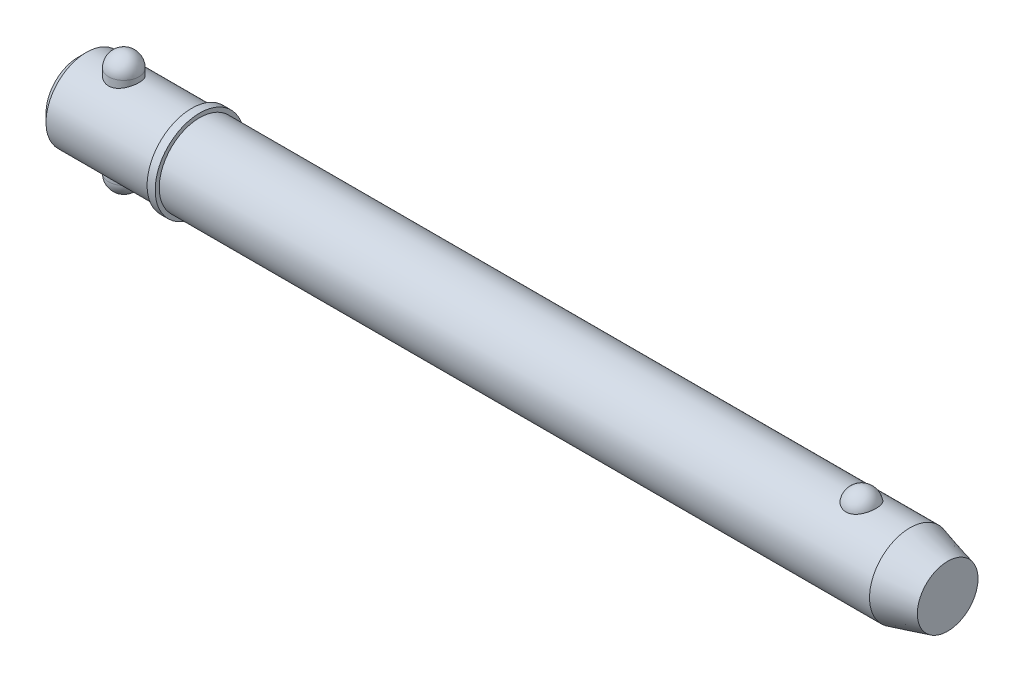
ISO-10303-21;
HEADER;
FILE_DESCRIPTION(('STEP AP214'),'2;1');
FILE_NAME('part.step','',(''),(''),'','','');
FILE_SCHEMA(('AUTOMOTIVE_DESIGN { 1 0 10303 214 1 1 1 1 }'));
ENDSEC;
DATA;
#1=APPLICATION_CONTEXT('core data for automotive mechanical design processes');
#2=APPLICATION_PROTOCOL_DEFINITION('international standard','automotive_design',2000,#1);
#3=PRODUCT_CONTEXT('',#1,'mechanical');
#4=PRODUCT('Part','Part','',(#3));
#5=PRODUCT_RELATED_PRODUCT_CATEGORY('part','',(#4));
#6=PRODUCT_DEFINITION_FORMATION('','',#4);
#7=PRODUCT_DEFINITION_CONTEXT('part definition',#1,'design');
#8=PRODUCT_DEFINITION('design','',#6,#7);
#9=PRODUCT_DEFINITION_SHAPE('','',#8);
#10=(LENGTH_UNIT() NAMED_UNIT(*) SI_UNIT(.MILLI.,.METRE.));
#11=(NAMED_UNIT(*) PLANE_ANGLE_UNIT() SI_UNIT($,.RADIAN.));
#12=(NAMED_UNIT(*) SI_UNIT($,.STERADIAN.) SOLID_ANGLE_UNIT());
#13=UNCERTAINTY_MEASURE_WITH_UNIT(LENGTH_MEASURE(1.E-05),#10,'distance_accuracy_value','');
#14=(GEOMETRIC_REPRESENTATION_CONTEXT(3) GLOBAL_UNCERTAINTY_ASSIGNED_CONTEXT((#13)) GLOBAL_UNIT_ASSIGNED_CONTEXT((#10,
#11,#12)) REPRESENTATION_CONTEXT('',''));
#15=CARTESIAN_POINT('',(0.,0.,0.));
#16=DIRECTION('',(0.,0.,1.));
#17=DIRECTION('',(1.,0.,0.));
#18=AXIS2_PLACEMENT_3D('',#15,#16,#17);
#19=CARTESIAN_POINT('',(14.28,19.05,0.));
#20=DIRECTION('',(0.,-1.,0.));
#21=DIRECTION('',(0.,0.,-1.));
#22=AXIS2_PLACEMENT_3D('',#19,#20,#21);
#23=CYLINDRICAL_SURFACE('',#22,4.76);
#24=CARTESIAN_POINT('',(14.28,-14.29,0.));
#25=DIRECTION('',(0.,-1.,0.));
#26=DIRECTION('',(0.,0.,-1.));
#27=AXIS2_PLACEMENT_3D('',#24,#25,#26);
#28=CIRCLE('',#27,4.76);
#29=CARTESIAN_POINT('',(14.28,-14.29,-4.76));
#30=VERTEX_POINT('',#29);
#31=EDGE_CURVE('P0_E10',#30,#30,#28,.F.);
#32=CARTESIAN_POINT('',(14.28,14.29,0.));
#33=DIRECTION('',(0.,-1.,0.));
#34=DIRECTION('',(0.,0.,-1.));
#35=AXIS2_PLACEMENT_3D('',#32,#33,#34);
#36=CIRCLE('',#35,4.76);
#37=CARTESIAN_POINT('',(14.28,14.29,-4.76));
#38=VERTEX_POINT('',#37);
#39=EDGE_CURVE('P0_E21',#38,#38,#36,.T.);
#40=CARTESIAN_POINT('',(14.28,-14.29,-4.76));
#41=CARTESIAN_POINT('',(14.28,-13.9922916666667,-4.76));
#42=CARTESIAN_POINT('',(14.28,-13.6945833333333,-4.76));
#43=CARTESIAN_POINT('',(14.28,-13.0991666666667,-4.76));
#44=CARTESIAN_POINT('',(14.28,-12.8014583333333,-4.76));
#45=CARTESIAN_POINT('',(14.28,-12.2060416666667,-4.76));
#46=CARTESIAN_POINT('',(14.28,-11.9083333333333,-4.76));
#47=CARTESIAN_POINT('',(14.28,-11.3129166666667,-4.76));
#48=CARTESIAN_POINT('',(14.28,-11.0152083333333,-4.76));
#49=CARTESIAN_POINT('',(14.28,-10.4197916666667,-4.76));
#50=CARTESIAN_POINT('',(14.28,-10.1220833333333,-4.76));
#51=CARTESIAN_POINT('',(14.28,-9.52666666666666,-4.76));
#52=CARTESIAN_POINT('',(14.28,-9.22895833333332,-4.76));
#53=CARTESIAN_POINT('',(14.28,-8.63354166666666,-4.76));
#54=CARTESIAN_POINT('',(14.28,-8.33583333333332,-4.76));
#55=CARTESIAN_POINT('',(14.28,-7.74041666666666,-4.76));
#56=CARTESIAN_POINT('',(14.28,-7.44270833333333,-4.76));
#57=CARTESIAN_POINT('',(14.28,-6.84729166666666,-4.76));
#58=CARTESIAN_POINT('',(14.28,-6.54958333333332,-4.76));
#59=CARTESIAN_POINT('',(14.28,-5.95416666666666,-4.76));
#60=CARTESIAN_POINT('',(14.28,-5.65645833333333,-4.76));
#61=CARTESIAN_POINT('',(14.28,-5.06104166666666,-4.76));
#62=CARTESIAN_POINT('',(14.28,-4.76333333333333,-4.76));
#63=CARTESIAN_POINT('',(14.28,-4.16791666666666,-4.76));
#64=CARTESIAN_POINT('',(14.28,-3.87020833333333,-4.76));
#65=CARTESIAN_POINT('',(14.28,-3.27479166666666,-4.76));
#66=CARTESIAN_POINT('',(14.28,-2.97708333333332,-4.76));
#67=CARTESIAN_POINT('',(14.28,-2.38166666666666,-4.76));
#68=CARTESIAN_POINT('',(14.28,-2.08395833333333,-4.76));
#69=CARTESIAN_POINT('',(14.28,-1.48854166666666,-4.76));
#70=CARTESIAN_POINT('',(14.28,-1.19083333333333,-4.76));
#71=CARTESIAN_POINT('',(14.28,-0.595416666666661,-4.76));
#72=CARTESIAN_POINT('',(14.28,-0.297708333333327,-4.76));
#73=CARTESIAN_POINT('',(14.28,0.297708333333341,-4.76));
#74=CARTESIAN_POINT('',(14.28,0.595416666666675,-4.76));
#75=CARTESIAN_POINT('',(14.28,1.19083333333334,-4.76));
#76=CARTESIAN_POINT('',(14.28,1.48854166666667,-4.76));
#77=CARTESIAN_POINT('',(14.28,2.08395833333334,-4.76));
#78=CARTESIAN_POINT('',(14.28,2.38166666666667,-4.76));
#79=CARTESIAN_POINT('',(14.28,2.97708333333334,-4.76));
#80=CARTESIAN_POINT('',(14.28,3.27479166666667,-4.76));
#81=CARTESIAN_POINT('',(14.28,3.87020833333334,-4.76));
#82=CARTESIAN_POINT('',(14.28,4.16791666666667,-4.76));
#83=CARTESIAN_POINT('',(14.28,4.76333333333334,-4.76));
#84=CARTESIAN_POINT('',(14.28,5.06104166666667,-4.76));
#85=CARTESIAN_POINT('',(14.28,5.65645833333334,-4.76));
#86=CARTESIAN_POINT('',(14.28,5.95416666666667,-4.76));
#87=CARTESIAN_POINT('',(14.28,6.54958333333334,-4.76));
#88=CARTESIAN_POINT('',(14.28,6.84729166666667,-4.76));
#89=CARTESIAN_POINT('',(14.28,7.44270833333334,-4.76));
#90=CARTESIAN_POINT('',(14.28,7.74041666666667,-4.76));
#91=CARTESIAN_POINT('',(14.28,8.33583333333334,-4.76));
#92=CARTESIAN_POINT('',(14.28,8.63354166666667,-4.76));
#93=CARTESIAN_POINT('',(14.28,9.22895833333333,-4.76));
#94=CARTESIAN_POINT('',(14.28,9.52666666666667,-4.76));
#95=CARTESIAN_POINT('',(14.28,10.1220833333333,-4.76));
#96=CARTESIAN_POINT('',(14.28,10.4197916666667,-4.76));
#97=CARTESIAN_POINT('',(14.28,11.0152083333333,-4.76));
#98=CARTESIAN_POINT('',(14.28,11.3129166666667,-4.76));
#99=CARTESIAN_POINT('',(14.28,11.9083333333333,-4.76));
#100=CARTESIAN_POINT('',(14.28,12.2060416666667,-4.76));
#101=CARTESIAN_POINT('',(14.28,12.8014583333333,-4.76));
#102=CARTESIAN_POINT('',(14.28,13.0991666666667,-4.76));
#103=CARTESIAN_POINT('',(14.28,13.6945833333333,-4.76));
#104=CARTESIAN_POINT('',(14.28,13.9922916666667,-4.76));
#105=CARTESIAN_POINT('',(14.28,14.29,-4.76));
#106=B_SPLINE_CURVE_WITH_KNOTS('',3,(#40,#41,#42,#43,#44,#45,#46,#47,#48,#49,#50,#51,#52,#53,
#54,#55,#56,#57,#58,#59,#60,#61,#62,#63,#64,#65,#66,#67,#68,#69,#70,#71,#72,#73,#74,#75,#76,#77,
#78,#79,#80,#81,#82,#83,#84,#85,#86,#87,#88,#89,#90,#91,#92,#93,#94,#95,#96,#97,#98,#99,#100,
#101,#102,#103,#104,#105),.UNSPECIFIED.,.F.,.F.,(4,2,2,2,2,2,2,2,2,2,2,2,2,2,2,2,2,2,2,2,2,2,2,
2,2,2,2,2,2,2,2,2,4),(0.,0.893125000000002,1.78625,2.67937499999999,3.5725,4.465625,5.35875,
6.25187499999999,7.145,8.038125,8.93125,9.82437499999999,10.7175,11.610625,12.50375,13.396875,
14.29,15.183125,16.07625,16.969375,17.8625,18.755625,19.64875,20.541875,21.435,22.328125,
23.22125,24.114375,25.0075,25.900625,26.79375,27.686875,28.58),.UNSPECIFIED.);
#107=EDGE_CURVE('P0_BSEAM14',#30,#38,#106,.T.);
#108=ORIENTED_EDGE('',*,*,#31,.T.);
#109=ORIENTED_EDGE('',*,*,#39,.T.);
#110=ORIENTED_EDGE('',*,*,#107,.T.);
#111=ORIENTED_EDGE('',*,*,#107,.F.);
#112=EDGE_LOOP('',(#108,#110,#109,#111));
#113=FACE_BOUND('',#112,.T.);
#114=ADVANCED_FACE('P0_F14',(#113),#23,.T.);
#115=CARTESIAN_POINT('',(14.28,-14.29,0.));
#116=DIRECTION('',(0.,0.,1.));
#117=DIRECTION('',(1.,0.,0.));
#118=AXIS2_PLACEMENT_3D('',#115,#116,#117);
#119=SPHERICAL_SURFACE('',#118,4.76);
#120=CARTESIAN_POINT('',(14.28,-14.29,0.));
#121=DIRECTION('',(0.,-1.,0.));
#122=DIRECTION('',(0.,0.,-1.));
#123=AXIS2_PLACEMENT_3D('',#120,#121,#122);
#124=SPHERICAL_SURFACE('',#123,4.76);
#125=ORIENTED_EDGE('',*,*,#31,.F.);
#126=EDGE_LOOP('',(#125));
#127=FACE_BOUND('',#126,.T.);
#128=ADVANCED_FACE('P0_F29',(#127),#124,.T.);
#129=CARTESIAN_POINT('',(14.28,14.29,0.));
#130=DIRECTION('',(0.,0.,1.));
#131=DIRECTION('',(1.,0.,0.));
#132=AXIS2_PLACEMENT_3D('',#129,#130,#131);
#133=SPHERICAL_SURFACE('',#132,4.76);
#134=CARTESIAN_POINT('',(14.28,14.29,0.));
#135=DIRECTION('',(0.,-1.,0.));
#136=DIRECTION('',(0.,0.,-1.));
#137=AXIS2_PLACEMENT_3D('',#134,#135,#136);
#138=SPHERICAL_SURFACE('',#137,4.76);
#139=ORIENTED_EDGE('',*,*,#39,.F.);
#140=EDGE_LOOP('',(#139));
#141=FACE_BOUND('',#140,.T.);
#142=ADVANCED_FACE('P0_F16',(#141),#138,.T.);
#143=CLOSED_SHELL('',(#114,#128,#142));
#144=MANIFOLD_SOLID_BREP('P0_B1',#143);
#145=CARTESIAN_POINT('',(0.,0.,0.));
#146=DIRECTION('',(1.,0.,0.));
#147=DIRECTION('',(0.,0.,-1.));
#148=AXIS2_PLACEMENT_3D('',#145,#146,#147);
#149=CYLINDRICAL_SURFACE('',#148,12.7);
#150=CARTESIAN_POINT('',(261.200738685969,0.,0.));
#151=DIRECTION('',(1.,0.,0.));
#152=DIRECTION('',(0.,0.,-1.));
#153=AXIS2_PLACEMENT_3D('',#150,#151,#152);
#154=CIRCLE('',#153,12.7);
#155=CARTESIAN_POINT('',(261.200738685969,0.,-12.7));
#156=VERTEX_POINT('',#155);
#157=EDGE_CURVE('P1_E81',#156,#156,#154,.T.);
#158=ORIENTED_EDGE('',*,*,#157,.F.);
#159=EDGE_LOOP('',(#158));
#160=FACE_BOUND('',#159,.T.);
#161=CARTESIAN_POINT('',(38.1,0.,0.));
#162=DIRECTION('',(1.,0.,0.));
#163=DIRECTION('',(0.,0.,-1.));
#164=AXIS2_PLACEMENT_3D('',#161,#162,#163);
#165=CIRCLE('',#164,12.7);
#166=CARTESIAN_POINT('',(38.1,0.,-12.7));
#167=VERTEX_POINT('',#166);
#168=EDGE_CURVE('P1_E85',#167,#167,#165,.T.);
#169=ORIENTED_EDGE('',*,*,#168,.T.);
#170=EDGE_LOOP('',(#169));
#171=FACE_BOUND('',#170,.T.);
#172=CARTESIAN_POINT('',(245.960042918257,11.7500437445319,4.81938502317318));
#173=CARTESIAN_POINT('',(245.835088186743,11.7500430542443,4.81938571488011));
#174=CARTESIAN_POINT('',(245.710144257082,11.7520975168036,4.81438658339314));
#175=CARTESIAN_POINT('',(245.461142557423,11.760253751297,4.79442904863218));
#176=CARTESIAN_POINT('',(245.337085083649,11.7663568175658,4.77946746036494));
#177=CARTESIAN_POINT('',(245.090901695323,11.7824262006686,4.7397141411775));
#178=CARTESIAN_POINT('',(244.968774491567,11.7923898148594,4.71492928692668));
#179=CARTESIAN_POINT('',(244.727187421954,11.8158938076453,4.65571340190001));
#180=CARTESIAN_POINT('',(244.60772859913,11.8294355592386,4.6212786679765));
#181=CARTESIAN_POINT('',(244.372557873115,11.8596812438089,4.54309502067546));
#182=CARTESIAN_POINT('',(244.256839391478,11.8763792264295,4.49936361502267));
#183=CARTESIAN_POINT('',(244.029653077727,11.9124878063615,4.40287235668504));
#184=CARTESIAN_POINT('',(243.918186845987,11.9318994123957,4.35010914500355));
#185=CARTESIAN_POINT('',(243.591278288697,11.9934256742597,4.17881316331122));
#186=CARTESIAN_POINT('',(243.383127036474,12.038858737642,4.04720756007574));
#187=CARTESIAN_POINT('',(242.985850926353,12.1352173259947,3.748564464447));
#188=CARTESIAN_POINT('',(242.797443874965,12.1862630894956,3.58061821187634));
#189=CARTESIAN_POINT('',(242.450521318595,12.2875163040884,3.21600758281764));
#190=CARTESIAN_POINT('',(242.292011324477,12.3377235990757,3.0193379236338));
#191=CARTESIAN_POINT('',(242.00168878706,12.4344923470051,2.592916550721));
#192=CARTESIAN_POINT('',(241.871376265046,12.4807925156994,2.36208286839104));
#193=CARTESIAN_POINT('',(241.649407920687,12.5623454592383,1.88070399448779));
#194=CARTESIAN_POINT('',(241.557755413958,12.5975972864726,1.63015711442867));
#195=CARTESIAN_POINT('',(241.414046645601,12.6538414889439,1.1129886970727));
#196=CARTESIAN_POINT('',(241.362499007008,12.6746503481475,0.846205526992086));
#197=CARTESIAN_POINT('',(241.301977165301,12.699153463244,0.307085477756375));
#198=CARTESIAN_POINT('',(241.293001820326,12.7028481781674,0.034748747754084));
#199=CARTESIAN_POINT('',(241.317731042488,12.6927785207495,-0.506073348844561));
#200=CARTESIAN_POINT('',(241.351189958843,12.6791146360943,-0.774571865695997));
#201=CARTESIAN_POINT('',(241.459687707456,12.635882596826,-1.30170246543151));
#202=CARTESIAN_POINT('',(241.53472729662,12.606314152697,-1.56033436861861));
#203=CARTESIAN_POINT('',(241.72500006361,12.5342328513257,-2.0608389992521));
#204=CARTESIAN_POINT('',(241.840287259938,12.4917026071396,-2.30268867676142));
#205=CARTESIAN_POINT('',(242.108704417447,12.3981123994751,-2.76259600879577));
#206=CARTESIAN_POINT('',(242.261837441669,12.3470517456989,-2.98065173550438));
#207=CARTESIAN_POINT('',(242.603507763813,12.2416045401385,-3.38786328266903));
#208=CARTESIAN_POINT('',(242.792201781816,12.1872040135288,-3.57688418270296));
#209=CARTESIAN_POINT('',(243.200239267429,12.0814086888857,-3.91941073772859));
#210=CARTESIAN_POINT('',(243.419580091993,12.0300136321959,-4.07291945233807));
#211=CARTESIAN_POINT('',(243.878375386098,11.9373542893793,-4.33691289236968));
#212=CARTESIAN_POINT('',(244.117304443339,11.8958982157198,-4.44824125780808));
#213=CARTESIAN_POINT('',(244.61243761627,11.8268116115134,-4.62881985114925));
#214=CARTESIAN_POINT('',(244.868635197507,11.7991758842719,-4.69808589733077));
#215=CARTESIAN_POINT('',(245.377164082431,11.7622209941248,-4.78983181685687));
#216=CARTESIAN_POINT('',(245.629041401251,11.7520502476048,-4.81449025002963));
#217=CARTESIAN_POINT('',(246.133573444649,11.7485796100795,-4.82295735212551));
#218=CARTESIAN_POINT('',(246.386228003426,11.7552763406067,-4.80677420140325));
#219=CARTESIAN_POINT('',(246.876834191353,11.7842584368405,-4.73525430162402));
#220=CARTESIAN_POINT('',(247.114998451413,11.8060486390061,-4.68116061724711));
#221=CARTESIAN_POINT('',(247.578489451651,11.8622750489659,-4.53678133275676));
#222=CARTESIAN_POINT('',(247.803815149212,11.8967122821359,-4.44649279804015));
#223=CARTESIAN_POINT('',(248.240801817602,11.9754603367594,-4.2298761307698));
#224=CARTESIAN_POINT('',(248.452057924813,12.0199699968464,-4.10280539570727));
#225=CARTESIAN_POINT('',(248.850601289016,12.1138028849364,-3.81685409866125));
#226=CARTESIAN_POINT('',(249.037883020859,12.163127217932,-3.65796622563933));
#227=CARTESIAN_POINT('',(249.393350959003,12.2642343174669,-3.30364864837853));
#228=CARTESIAN_POINT('',(249.560111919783,12.3160165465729,-3.10678783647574));
#229=CARTESIAN_POINT('',(249.859579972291,12.4142566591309,-2.68748409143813));
#230=CARTESIAN_POINT('',(249.992280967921,12.4607135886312,-2.46503658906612));
#231=CARTESIAN_POINT('',(250.224691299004,12.5450236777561,-1.99289519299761));
#232=CARTESIAN_POINT('',(250.323215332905,12.5825557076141,-1.74255918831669));
#233=CARTESIAN_POINT('',(250.479227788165,12.6431720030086,-1.22773734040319));
#234=CARTESIAN_POINT('',(250.536715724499,12.6662560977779,-0.963251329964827));
#235=CARTESIAN_POINT('',(250.609544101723,12.6956486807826,-0.427355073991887));
#236=CARTESIAN_POINT('',(250.624837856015,12.7019385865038,-0.155937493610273));
#237=CARTESIAN_POINT('',(250.612779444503,12.6970201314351,0.385928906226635));
#238=CARTESIAN_POINT('',(250.58542805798,12.6858120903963,0.65637774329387));
#239=CARTESIAN_POINT('',(250.513060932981,12.6568455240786,1.05454017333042));
#240=CARTESIAN_POINT('',(250.483796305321,12.6451962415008,1.185778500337));
#241=CARTESIAN_POINT('',(250.415022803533,12.6181819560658,1.44513808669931));
#242=CARTESIAN_POINT('',(250.375517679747,12.6028183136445,1.57326046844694));
#243=CARTESIAN_POINT('',(250.286439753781,12.5687547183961,1.82554978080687));
#244=CARTESIAN_POINT('',(250.236862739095,12.5500533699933,1.9497150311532));
#245=CARTESIAN_POINT('',(250.12792115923,12.5098093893,2.1931437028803));
#246=CARTESIAN_POINT('',(250.068560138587,12.4882677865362,2.31240887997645));
#247=CARTESIAN_POINT('',(249.93997128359,12.4427679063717,2.54593031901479));
#248=CARTESIAN_POINT('',(249.870688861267,12.4187964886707,2.66015396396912));
#249=CARTESIAN_POINT('',(249.722903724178,12.3691892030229,2.88202659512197));
#250=CARTESIAN_POINT('',(249.644404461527,12.3435539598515,2.98967802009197));
#251=CARTESIAN_POINT('',(249.478550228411,12.2912955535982,3.19774385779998));
#252=CARTESIAN_POINT('',(249.391191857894,12.2646720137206,3.29815546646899));
#253=CARTESIAN_POINT('',(249.208161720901,12.2111945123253,3.49095035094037));
#254=CARTESIAN_POINT('',(249.112493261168,12.1843406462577,3.58333679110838));
#255=CARTESIAN_POINT('',(248.913627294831,12.1312249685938,3.75922876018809));
#256=CARTESIAN_POINT('',(248.810450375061,12.104961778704,3.84275713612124));
#257=CARTESIAN_POINT('',(248.597013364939,12.0537284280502,4.00056406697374));
#258=CARTESIAN_POINT('',(248.486756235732,12.028757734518,4.07484645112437));
#259=CARTESIAN_POINT('',(248.259755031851,11.9808306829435,4.21367959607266));
#260=CARTESIAN_POINT('',(248.143006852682,11.9578756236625,4.27822410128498));
#261=CARTESIAN_POINT('',(247.90394258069,11.9147184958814,4.39698483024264));
#262=CARTESIAN_POINT('',(247.781628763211,11.894515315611,4.45120522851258));
#263=CARTESIAN_POINT('',(247.522952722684,11.8561129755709,4.55255353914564));
#264=CARTESIAN_POINT('',(247.386223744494,11.8381764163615,4.59884858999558));
#265=CARTESIAN_POINT('',(247.108608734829,11.8069093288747,4.67853897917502));
#266=CARTESIAN_POINT('',(246.967724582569,11.7935767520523,4.71194005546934));
#267=CARTESIAN_POINT('',(246.68309446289,11.7720277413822,4.76552188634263));
#268=CARTESIAN_POINT('',(246.539348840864,11.7638106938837,4.78570422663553));
#269=CARTESIAN_POINT('',(246.250411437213,11.7528195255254,4.81263433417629));
#270=CARTESIAN_POINT('',(246.105219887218,11.7500445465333,4.81938421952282));
#271=CARTESIAN_POINT('',(245.960042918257,11.7500437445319,4.81938502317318));
#272=B_SPLINE_CURVE_WITH_KNOTS('',3,(#172,#173,#174,#175,#176,#177,#178,#179,#180,#181,#182,
#183,#184,#185,#186,#187,#188,#189,#190,#191,#192,#193,#194,#195,#196,#197,#198,#199,#200,#201,
#202,#203,#204,#205,#206,#207,#208,#209,#210,#211,#212,#213,#214,#215,#216,#217,#218,#219,#220,
#221,#222,#223,#224,#225,#226,#227,#228,#229,#230,#231,#232,#233,#234,#235,#236,#237,#238,#239,
#240,#241,#242,#243,#244,#245,#246,#247,#248,#249,#250,#251,#252,#253,#254,#255,#256,#257,#258,
#259,#260,#261,#262,#263,#264,#265,#266,#267,#268,#269,#270,#271),.UNSPECIFIED.,.T.,.F.,(4,2,2,
2,2,2,2,2,2,2,2,2,2,2,2,2,2,2,2,2,2,2,2,2,2,2,2,2,2,2,2,2,2,2,2,2,2,2,2,2,2,2,2,2,2,2,2,2,2,4),
(0.,0.374729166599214,0.749578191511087,1.12416526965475,1.49889629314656,1.87292776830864,
2.24709865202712,2.99481328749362,3.76399449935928,4.53331735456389,5.3368391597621,
6.14042986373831,6.95405296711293,7.76765424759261,8.57656703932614,9.38549455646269,
10.1955119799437,11.0055949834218,11.8193353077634,12.6330054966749,13.4294141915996,
14.2255231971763,14.9815786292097,15.7374826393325,16.4696948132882,17.2019663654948,
17.9501979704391,18.6986017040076,19.484470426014,20.2704797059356,21.0815215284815,
21.8925729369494,22.7045213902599,23.5164550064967,23.9209608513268,24.3253187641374,
24.7298461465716,25.1342272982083,25.54092555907,25.9474719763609,26.3541750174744,
26.7607169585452,27.1661834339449,27.5714814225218,27.9770386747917,28.3824315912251,
28.8181206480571,29.2536155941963,29.6890582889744,30.1244323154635),.UNSPECIFIED.);
#273=CARTESIAN_POINT('',(245.960042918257,11.7500437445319,4.81938502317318));
#274=VERTEX_POINT('',#273);
#275=EDGE_CURVE('P1_E35',#274,#274,#272,.T.);
#276=ORIENTED_EDGE('',*,*,#275,.T.);
#277=EDGE_LOOP('',(#276));
#278=FACE_BOUND('',#277,.T.);
#279=ADVANCED_FACE('P1_F13',(#160,#171,#278),#149,.T.);
#280=CARTESIAN_POINT('',(0.,0.,0.));
#281=DIRECTION('',(-1.,0.,0.));
#282=DIRECTION('',(0.,0.,1.));
#283=AXIS2_PLACEMENT_3D('',#280,#281,#282);
#284=PLANE('',#283);
#285=CARTESIAN_POINT('',(0.,0.,0.));
#286=DIRECTION('',(1.,0.,0.));
#287=DIRECTION('',(0.,0.,-1.));
#288=AXIS2_PLACEMENT_3D('',#285,#286,#287);
#289=CIRCLE('',#288,10.16);
#290=CARTESIAN_POINT('',(0.,0.,-10.16));
#291=VERTEX_POINT('',#290);
#292=EDGE_CURVE('P1_E9',#291,#291,#289,.T.);
#293=ORIENTED_EDGE('',*,*,#292,.F.);
#294=EDGE_LOOP('',(#293));
#295=FACE_BOUND('',#294,.T.);
#296=ADVANCED_FACE('P1_F15',(#295),#284,.T.);
#297=CARTESIAN_POINT('',(2.53999999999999,0.,0.));
#298=DIRECTION('',(1.,0.,0.));
#299=DIRECTION('',(0.,0.,-1.));
#300=AXIS2_PLACEMENT_3D('',#297,#298,#299);
#301=CONICAL_SURFACE('',#300,12.7,0.78539816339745);
#302=ORIENTED_EDGE('',*,*,#292,.T.);
#303=EDGE_LOOP('',(#302));
#304=FACE_BOUND('',#303,.T.);
#305=CARTESIAN_POINT('',(2.53999999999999,0.,0.));
#306=DIRECTION('',(1.,0.,0.));
#307=DIRECTION('',(0.,0.,-1.));
#308=AXIS2_PLACEMENT_3D('',#305,#306,#307);
#309=CIRCLE('',#308,12.7);
#310=CARTESIAN_POINT('',(2.53999999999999,0.,-12.7));
#311=VERTEX_POINT('',#310);
#312=EDGE_CURVE('P1_E26',#311,#311,#309,.T.);
#313=ORIENTED_EDGE('',*,*,#312,.F.);
#314=EDGE_LOOP('',(#313));
#315=FACE_BOUND('',#314,.T.);
#316=ADVANCED_FACE('P1_F77',(#304,#315),#301,.T.);
#317=CARTESIAN_POINT('',(0.,0.,0.));
#318=DIRECTION('',(1.,0.,0.));
#319=DIRECTION('',(0.,0.,-1.));
#320=AXIS2_PLACEMENT_3D('',#317,#318,#319);
#321=CYLINDRICAL_SURFACE('',#320,12.7);
#322=CARTESIAN_POINT('',(14.28,-11.7742260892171,4.76));
#323=CARTESIAN_POINT('',(14.1514948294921,-11.7742255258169,4.76000061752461));
#324=CARTESIAN_POINT('',(14.0229980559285,-11.7763355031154,4.75479194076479));
#325=CARTESIAN_POINT('',(13.7669369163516,-11.7847043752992,4.73401198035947));
#326=CARTESIAN_POINT('',(13.6393728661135,-11.7909646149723,4.71843733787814));
#327=CARTESIAN_POINT('',(13.386226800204,-11.8074248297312,4.67709434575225));
#328=CARTESIAN_POINT('',(13.2606439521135,-11.8176231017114,4.65133040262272));
#329=CARTESIAN_POINT('',(13.0122434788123,-11.8416347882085,4.58985545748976));
#330=CARTESIAN_POINT('',(12.8894269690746,-11.8554496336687,4.55414051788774));
#331=CARTESIAN_POINT('',(12.6477622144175,-11.8862222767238,4.47320764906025));
#332=CARTESIAN_POINT('',(12.5289037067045,-11.9031710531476,4.4280169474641));
#333=CARTESIAN_POINT('',(12.2955059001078,-11.939736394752,4.32845291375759));
#334=CARTESIAN_POINT('',(12.1809682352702,-11.9593539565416,4.2740761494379));
#335=CARTESIAN_POINT('',(11.8448901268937,-12.0213893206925,4.09777237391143));
#336=CARTESIAN_POINT('',(11.6307077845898,-12.0670135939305,3.9626122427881));
#337=CARTESIAN_POINT('',(11.2179129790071,-12.1641514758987,3.65386230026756));
#338=CARTESIAN_POINT('',(11.0204399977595,-12.2158379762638,3.47881300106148));
#339=CARTESIAN_POINT('',(10.6568212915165,-12.3178468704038,3.09829182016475));
#340=CARTESIAN_POINT('',(10.4906822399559,-12.3681689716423,2.89281347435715));
#341=CARTESIAN_POINT('',(10.1890299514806,-12.4638367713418,2.44867909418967));
#342=CARTESIAN_POINT('',(10.054749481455,-12.5089552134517,2.20913281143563));
#343=CARTESIAN_POINT('',(9.82886079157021,-12.5870472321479,1.70885919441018));
#344=CARTESIAN_POINT('',(9.73723778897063,-12.620025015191,1.44813923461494));
#345=CARTESIAN_POINT('',(9.60324488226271,-12.6688874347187,0.9248423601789));
#346=CARTESIAN_POINT('',(9.55892269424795,-12.6854474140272,0.662829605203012));
#347=CARTESIAN_POINT('',(9.5145335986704,-12.7020320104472,0.134596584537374));
#348=CARTESIAN_POINT('',(9.5144523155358,-12.7020619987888,-0.131622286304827));
#349=CARTESIAN_POINT('',(9.55741019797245,-12.6860129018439,-0.646717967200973));
#350=CARTESIAN_POINT('',(9.59831845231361,-12.6707298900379,-0.895801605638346));
#351=CARTESIAN_POINT('',(9.71850987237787,-12.6268158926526,-1.38327219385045));
#352=CARTESIAN_POINT('',(9.79779575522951,-12.5981839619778,-1.62165838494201));
#353=CARTESIAN_POINT('',(9.99348296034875,-12.5298894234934,-2.08508424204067));
#354=CARTESIAN_POINT('',(10.110407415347,-12.4900724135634,-2.30987931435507));
#355=CARTESIAN_POINT('',(10.3775896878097,-12.4034373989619,-2.7372158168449));
#356=CARTESIAN_POINT('',(10.5278582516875,-12.3566171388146,-2.93975004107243));
#357=CARTESIAN_POINT('',(10.8677318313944,-12.257571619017,-3.32936830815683));
#358=CARTESIAN_POINT('',(11.0591227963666,-12.2051903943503,-3.51485714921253));
#359=CARTESIAN_POINT('',(11.4706087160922,-12.1031155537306,-3.85170663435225));
#360=CARTESIAN_POINT('',(11.6907108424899,-12.0534226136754,-4.00305872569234));
#361=CARTESIAN_POINT('',(12.1596597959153,-11.9613684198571,-4.27038218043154));
#362=CARTESIAN_POINT('',(12.4090353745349,-11.9191939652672,-4.38549550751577));
#363=CARTESIAN_POINT('',(12.9256290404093,-11.8491124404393,-4.57149117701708));
#364=CARTESIAN_POINT('',(13.1928371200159,-11.8211974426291,-4.64239810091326));
#365=CARTESIAN_POINT('',(13.7217488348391,-11.7846654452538,-4.73434137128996));
#366=CARTESIAN_POINT('',(13.9829438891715,-11.7750694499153,-4.75791141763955));
#367=CARTESIAN_POINT('',(14.5056760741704,-11.7734909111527,-4.76182097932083));
#368=CARTESIAN_POINT('',(14.7672131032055,-11.7815039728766,-4.74217128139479));
#369=CARTESIAN_POINT('',(15.2702140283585,-11.8132466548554,-4.66249544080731));
#370=CARTESIAN_POINT('',(15.5120417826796,-11.8362133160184,-4.60442726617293));
#371=CARTESIAN_POINT('',(15.9824097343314,-11.8943704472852,-4.45202868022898));
#372=CARTESIAN_POINT('',(16.2109472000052,-11.9295634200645,-4.35769084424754));
#373=CARTESIAN_POINT('',(16.6577741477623,-12.0098310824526,-4.13144368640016));
#374=CARTESIAN_POINT('',(16.8753590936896,-12.055226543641,-3.99825937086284));
#375=CARTESIAN_POINT('',(17.2859732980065,-12.150238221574,-3.69949845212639));
#376=CARTESIAN_POINT('',(17.4789935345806,-12.19985597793,-3.5339100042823));
#377=CARTESIAN_POINT('',(17.8477707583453,-12.3015434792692,-3.1624728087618));
#378=CARTESIAN_POINT('',(18.0216609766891,-12.3535695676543,-2.95473880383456));
#379=CARTESIAN_POINT('',(18.254545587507,-12.426745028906,-2.62277433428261));
#380=CARTESIAN_POINT('',(18.3275489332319,-12.4503382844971,-2.50865480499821));
#381=CARTESIAN_POINT('',(18.463723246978,-12.4952713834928,-2.27428971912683));
#382=CARTESIAN_POINT('',(18.5268984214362,-12.5166121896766,-2.15404681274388));
#383=CARTESIAN_POINT('',(18.6427140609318,-12.5563817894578,-1.90858448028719));
#384=CARTESIAN_POINT('',(18.6953855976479,-12.5748191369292,-1.78338108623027));
#385=CARTESIAN_POINT('',(18.7899337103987,-12.6083284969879,-1.52857834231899));
#386=CARTESIAN_POINT('',(18.8318147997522,-12.6234019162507,-1.39898085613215));
#387=CARTESIAN_POINT('',(18.9043819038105,-12.6497495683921,-1.13633254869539));
#388=CARTESIAN_POINT('',(18.9350698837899,-12.6610244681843,-1.00328233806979));
#389=CARTESIAN_POINT('',(18.9849303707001,-12.6794412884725,-0.734761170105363));
#390=CARTESIAN_POINT('',(19.0041035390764,-12.6865834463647,-0.59929035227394));
#391=CARTESIAN_POINT('',(19.0299427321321,-12.6962286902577,-0.335006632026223));
#392=CARTESIAN_POINT('',(19.0372742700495,-12.698978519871,-0.206267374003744));
#393=CARTESIAN_POINT('',(19.0414668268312,-12.7005496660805,0.0514515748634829));
#394=CARTESIAN_POINT('',(19.038324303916,-12.69936965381,0.180431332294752));
#395=CARTESIAN_POINT('',(19.0215965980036,-12.6931114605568,0.437551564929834));
#396=CARTESIAN_POINT('',(19.0080165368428,-12.6880351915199,0.565692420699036));
#397=CARTESIAN_POINT('',(18.9705519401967,-12.6741222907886,0.820297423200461));
#398=CARTESIAN_POINT('',(18.9466635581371,-12.665284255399,0.946760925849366));
#399=CARTESIAN_POINT('',(18.8895279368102,-12.6443449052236,1.19395899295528));
#400=CARTESIAN_POINT('',(18.8565273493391,-12.6323299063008,1.3147578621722));
#401=CARTESIAN_POINT('',(18.781239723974,-12.6052503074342,1.55308888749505));
#402=CARTESIAN_POINT('',(18.738949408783,-12.5901846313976,1.67061987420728));
#403=CARTESIAN_POINT('',(18.5986461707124,-12.5409473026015,2.01714406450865));
#404=CARTESIAN_POINT('',(18.4871532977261,-12.502717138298,2.24027279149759));
#405=CARTESIAN_POINT('',(18.2262440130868,-12.4173042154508,2.6742599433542));
#406=CARTESIAN_POINT('',(18.0754310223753,-12.3698127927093,2.88420891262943));
#407=CARTESIAN_POINT('',(17.7421836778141,-12.271667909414,3.27675114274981));
#408=CARTESIAN_POINT('',(17.5597380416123,-12.2210133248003,3.45933459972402));
#409=CARTESIAN_POINT('',(17.2605468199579,-12.1452079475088,3.7138066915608));
#410=CARTESIAN_POINT('',(17.1535518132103,-12.119328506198,3.79719993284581));
#411=CARTESIAN_POINT('',(16.9326449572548,-12.0688597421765,3.95467398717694));
#412=CARTESIAN_POINT('',(16.8187356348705,-12.0442699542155,4.02875817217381));
#413=CARTESIAN_POINT('',(16.5846234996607,-11.9971053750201,4.16711104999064));
#414=CARTESIAN_POINT('',(16.4644172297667,-11.9745317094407,4.23137427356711));
#415=CARTESIAN_POINT('',(16.2185866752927,-11.9321360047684,4.34949041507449));
#416=CARTESIAN_POINT('',(16.09296473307,-11.9123127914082,4.40334777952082));
#417=CARTESIAN_POINT('',(15.8314769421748,-11.875268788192,4.50232278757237));
#418=CARTESIAN_POINT('',(15.6954035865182,-11.8582009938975,4.54695127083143));
#419=CARTESIAN_POINT('',(15.4194002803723,-11.8284328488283,4.62383807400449));
#420=CARTESIAN_POINT('',(15.2794720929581,-11.815730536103,4.6561019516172));
#421=CARTESIAN_POINT('',(14.9969657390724,-11.7951940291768,4.70788444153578));
#422=CARTESIAN_POINT('',(14.8543884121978,-11.7873583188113,4.72740702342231));
#423=CARTESIAN_POINT('',(14.5678704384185,-11.7768749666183,4.75346370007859));
#424=CARTESIAN_POINT('',(14.4239299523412,-11.7742267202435,4.75999930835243));
#425=CARTESIAN_POINT('',(14.28,-11.7742260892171,4.76));
#426=B_SPLINE_CURVE_WITH_KNOTS('',3,(#322,#323,#324,#325,#326,#327,#328,#329,#330,#331,#332,
#333,#334,#335,#336,#337,#338,#339,#340,#341,#342,#343,#344,#345,#346,#347,#348,#349,#350,#351,
#352,#353,#354,#355,#356,#357,#358,#359,#360,#361,#362,#363,#364,#365,#366,#367,#368,#369,#370,
#371,#372,#373,#374,#375,#376,#377,#378,#379,#380,#381,#382,#383,#384,#385,#386,#387,#388,#389,
#390,#391,#392,#393,#394,#395,#396,#397,#398,#399,#400,#401,#402,#403,#404,#405,#406,#407,#408,
#409,#410,#411,#412,#413,#414,#415,#416,#417,#418,#419,#420,#421,#422,#423,#424,#425),
.UNSPECIFIED.,.T.,.F.,(4,2,2,2,2,2,2,2,2,2,2,2,2,2,2,2,2,2,2,2,2,2,2,2,2,2,2,2,2,2,2,2,2,2,2,2,
2,2,2,2,2,2,2,2,2,2,2,2,2,2,2,4),(0.,0.385378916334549,0.770882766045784,1.15622008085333,
1.54171009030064,1.92610725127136,2.31064835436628,3.07917291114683,3.88239385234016,
4.68578566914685,5.51648193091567,6.34689010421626,7.14151420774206,7.93588010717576,
8.69098665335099,9.44614666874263,10.2122918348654,10.9786842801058,11.789876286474,
12.6012713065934,13.4306405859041,14.2595482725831,15.0427613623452,15.8257790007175,
16.5716820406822,17.3177378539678,18.0917395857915,18.8660247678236,19.6893332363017,
20.1014571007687,20.5134040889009,20.9241137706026,21.3346513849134,21.7451168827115,
22.1555587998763,22.542011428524,22.928594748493,23.3149884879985,23.7015265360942,
24.0784835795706,24.4555738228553,25.2091300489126,25.994347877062,26.7798463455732,
27.1937428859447,27.6074890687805,28.0214648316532,28.4352633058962,28.8672794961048,
29.299101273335,29.7307884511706,30.1624253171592),.UNSPECIFIED.);
#427=CARTESIAN_POINT('',(14.28,-11.7742260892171,4.76));
#428=VERTEX_POINT('',#427);
#429=EDGE_CURVE('P1_E17',#428,#428,#426,.T.);
#430=ORIENTED_EDGE('',*,*,#429,.F.);
#431=EDGE_LOOP('',(#430));
#432=FACE_BOUND('',#431,.T.);
#433=CARTESIAN_POINT('',(14.28,11.7742260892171,4.76));
#434=CARTESIAN_POINT('',(14.4085051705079,11.7742255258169,4.76000061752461));
#435=CARTESIAN_POINT('',(14.5370019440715,11.7763355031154,4.75479194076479));
#436=CARTESIAN_POINT('',(14.7930630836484,11.7847043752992,4.73401198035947));
#437=CARTESIAN_POINT('',(14.9206271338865,11.7909646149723,4.71843733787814));
#438=CARTESIAN_POINT('',(15.173773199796,11.8074248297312,4.67709434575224));
#439=CARTESIAN_POINT('',(15.2993560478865,11.8176231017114,4.65133040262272));
#440=CARTESIAN_POINT('',(15.5477565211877,11.8416347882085,4.58985545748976));
#441=CARTESIAN_POINT('',(15.6705730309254,11.8554496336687,4.55414051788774));
#442=CARTESIAN_POINT('',(15.9122377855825,11.8862222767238,4.47320764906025));
#443=CARTESIAN_POINT('',(16.0310962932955,11.9031710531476,4.4280169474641));
#444=CARTESIAN_POINT('',(16.2644940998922,11.939736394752,4.32845291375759));
#445=CARTESIAN_POINT('',(16.3790317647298,11.9593539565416,4.2740761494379));
#446=CARTESIAN_POINT('',(16.7151098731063,12.0213893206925,4.09777237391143));
#447=CARTESIAN_POINT('',(16.9292922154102,12.0670135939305,3.96261224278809));
#448=CARTESIAN_POINT('',(17.3420870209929,12.1641514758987,3.65386230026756));
#449=CARTESIAN_POINT('',(17.5395600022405,12.2158379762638,3.47881300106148));
#450=CARTESIAN_POINT('',(17.9031787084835,12.3178468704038,3.09829182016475));
#451=CARTESIAN_POINT('',(18.0693177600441,12.3681689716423,2.89281347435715));
#452=CARTESIAN_POINT('',(18.3709700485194,12.4638367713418,2.44867909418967));
#453=CARTESIAN_POINT('',(18.505250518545,12.5089552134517,2.20913281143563));
#454=CARTESIAN_POINT('',(18.7311392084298,12.5870472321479,1.70885919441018));
#455=CARTESIAN_POINT('',(18.8227622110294,12.620025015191,1.44813923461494));
#456=CARTESIAN_POINT('',(18.9567551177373,12.6688874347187,0.924842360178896));
#457=CARTESIAN_POINT('',(19.0010773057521,12.6854474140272,0.662829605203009));
#458=CARTESIAN_POINT('',(19.0454664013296,12.7020320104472,0.134596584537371));
#459=CARTESIAN_POINT('',(19.0455476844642,12.7020619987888,-0.13162228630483));
#460=CARTESIAN_POINT('',(19.0025898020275,12.6860129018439,-0.646717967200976));
#461=CARTESIAN_POINT('',(18.9616815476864,12.6707298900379,-0.89580160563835));
#462=CARTESIAN_POINT('',(18.8414901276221,12.6268158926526,-1.38327219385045));
#463=CARTESIAN_POINT('',(18.7622042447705,12.5981839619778,-1.62165838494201));
#464=CARTESIAN_POINT('',(18.5665170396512,12.5298894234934,-2.08508424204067));
#465=CARTESIAN_POINT('',(18.449592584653,12.4900724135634,-2.30987931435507));
#466=CARTESIAN_POINT('',(18.1824103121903,12.4034373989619,-2.7372158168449));
#467=CARTESIAN_POINT('',(18.0321417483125,12.3566171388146,-2.93975004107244));
#468=CARTESIAN_POINT('',(17.6922681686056,12.257571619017,-3.32936830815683));
#469=CARTESIAN_POINT('',(17.5008772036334,12.2051903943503,-3.51485714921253));
#470=CARTESIAN_POINT('',(17.0893912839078,12.1031155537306,-3.85170663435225));
#471=CARTESIAN_POINT('',(16.8692891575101,12.0534226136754,-4.00305872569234));
#472=CARTESIAN_POINT('',(16.4003402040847,11.9613684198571,-4.27038218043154));
#473=CARTESIAN_POINT('',(16.1509646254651,11.9191939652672,-4.38549550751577));
#474=CARTESIAN_POINT('',(15.6343709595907,11.8491124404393,-4.57149117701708));
#475=CARTESIAN_POINT('',(15.367162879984,11.8211974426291,-4.64239810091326));
#476=CARTESIAN_POINT('',(14.8382511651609,11.7846654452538,-4.73434137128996));
#477=CARTESIAN_POINT('',(14.5770561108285,11.7750694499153,-4.75791141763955));
#478=CARTESIAN_POINT('',(14.0543239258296,11.7734909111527,-4.76182097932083));
#479=CARTESIAN_POINT('',(13.7927868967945,11.7815039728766,-4.74217128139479));
#480=CARTESIAN_POINT('',(13.2897859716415,11.8132466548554,-4.66249544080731));
#481=CARTESIAN_POINT('',(13.0479582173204,11.8362133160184,-4.60442726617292));
#482=CARTESIAN_POINT('',(12.5775902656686,11.8943704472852,-4.45202868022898));
#483=CARTESIAN_POINT('',(12.3490527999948,11.9295634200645,-4.35769084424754));
#484=CARTESIAN_POINT('',(11.9022258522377,12.0098310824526,-4.13144368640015));
#485=CARTESIAN_POINT('',(11.6846409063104,12.055226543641,-3.99825937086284));
#486=CARTESIAN_POINT('',(11.2740267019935,12.150238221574,-3.69949845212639));
#487=CARTESIAN_POINT('',(11.0810064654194,12.19985597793,-3.5339100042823));
#488=CARTESIAN_POINT('',(10.7122292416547,12.3015434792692,-3.1624728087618));
#489=CARTESIAN_POINT('',(10.5383390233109,12.3535695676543,-2.95473880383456));
#490=CARTESIAN_POINT('',(10.305454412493,12.426745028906,-2.6227743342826));
#491=CARTESIAN_POINT('',(10.2324510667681,12.4503382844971,-2.50865480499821));
#492=CARTESIAN_POINT('',(10.096276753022,12.4952713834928,-2.27428971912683));
#493=CARTESIAN_POINT('',(10.0331015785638,12.5166121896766,-2.15404681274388));
#494=CARTESIAN_POINT('',(9.91728593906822,12.5563817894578,-1.90858448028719));
#495=CARTESIAN_POINT('',(9.8646144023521,12.5748191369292,-1.78338108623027));
#496=CARTESIAN_POINT('',(9.77006628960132,12.6083284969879,-1.52857834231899));
#497=CARTESIAN_POINT('',(9.72818520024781,12.6234019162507,-1.39898085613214));
#498=CARTESIAN_POINT('',(9.65561809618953,12.6497495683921,-1.13633254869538));
#499=CARTESIAN_POINT('',(9.62493011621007,12.6610244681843,-1.00328233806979));
#500=CARTESIAN_POINT('',(9.57506962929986,12.6794412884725,-0.734761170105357));
#501=CARTESIAN_POINT('',(9.55589646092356,12.6865834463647,-0.599290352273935));
#502=CARTESIAN_POINT('',(9.53005726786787,12.6962286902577,-0.335006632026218));
#503=CARTESIAN_POINT('',(9.52272572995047,12.698978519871,-0.20626737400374));
#504=CARTESIAN_POINT('',(9.51853317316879,12.7005496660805,0.0514515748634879));
#505=CARTESIAN_POINT('',(9.52167569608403,12.69936965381,0.180431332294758));
#506=CARTESIAN_POINT('',(9.53840340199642,12.6931114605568,0.43755156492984));
#507=CARTESIAN_POINT('',(9.55198346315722,12.6880351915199,0.565692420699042));
#508=CARTESIAN_POINT('',(9.58944805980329,12.6741222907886,0.820297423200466));
#509=CARTESIAN_POINT('',(9.61333644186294,12.665284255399,0.946760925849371));
#510=CARTESIAN_POINT('',(9.67047206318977,12.6443449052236,1.19395899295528));
#511=CARTESIAN_POINT('',(9.7034726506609,12.6323299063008,1.31475786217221));
#512=CARTESIAN_POINT('',(9.77876027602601,12.6052503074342,1.55308888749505));
#513=CARTESIAN_POINT('',(9.82105059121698,12.5901846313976,1.67061987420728));
#514=CARTESIAN_POINT('',(9.96135382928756,12.5409473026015,2.01714406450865));
#515=CARTESIAN_POINT('',(10.0728467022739,12.502717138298,2.24027279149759));
#516=CARTESIAN_POINT('',(10.3337559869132,12.4173042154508,2.6742599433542));
#517=CARTESIAN_POINT('',(10.4845689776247,12.3698127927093,2.88420891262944));
#518=CARTESIAN_POINT('',(10.8178163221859,12.271667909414,3.27675114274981));
#519=CARTESIAN_POINT('',(11.0002619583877,12.2210133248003,3.45933459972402));
#520=CARTESIAN_POINT('',(11.2994531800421,12.1452079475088,3.7138066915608));
#521=CARTESIAN_POINT('',(11.4064481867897,12.119328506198,3.79719993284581));
#522=CARTESIAN_POINT('',(11.6273550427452,12.0688597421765,3.95467398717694));
#523=CARTESIAN_POINT('',(11.7412643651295,12.0442699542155,4.02875817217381));
#524=CARTESIAN_POINT('',(11.9753765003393,11.9971053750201,4.16711104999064));
#525=CARTESIAN_POINT('',(12.0955827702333,11.9745317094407,4.23137427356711));
#526=CARTESIAN_POINT('',(12.3414133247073,11.9321360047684,4.34949041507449));
#527=CARTESIAN_POINT('',(12.46703526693,11.9123127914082,4.40334777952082));
#528=CARTESIAN_POINT('',(12.7285230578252,11.875268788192,4.50232278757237));
#529=CARTESIAN_POINT('',(12.8645964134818,11.8582009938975,4.54695127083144));
#530=CARTESIAN_POINT('',(13.1405997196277,11.8284328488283,4.62383807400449));
#531=CARTESIAN_POINT('',(13.2805279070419,11.815730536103,4.6561019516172));
#532=CARTESIAN_POINT('',(13.5630342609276,11.7951940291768,4.70788444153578));
#533=CARTESIAN_POINT('',(13.7056115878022,11.7873583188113,4.72740702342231));
#534=CARTESIAN_POINT('',(13.9921295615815,11.7768749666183,4.75346370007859));
#535=CARTESIAN_POINT('',(14.1360700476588,11.7742267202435,4.75999930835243));
#536=CARTESIAN_POINT('',(14.28,11.7742260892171,4.76));
#537=B_SPLINE_CURVE_WITH_KNOTS('',3,(#433,#434,#435,#436,#437,#438,#439,#440,#441,#442,#443,
#444,#445,#446,#447,#448,#449,#450,#451,#452,#453,#454,#455,#456,#457,#458,#459,#460,#461,#462,
#463,#464,#465,#466,#467,#468,#469,#470,#471,#472,#473,#474,#475,#476,#477,#478,#479,#480,#481,
#482,#483,#484,#485,#486,#487,#488,#489,#490,#491,#492,#493,#494,#495,#496,#497,#498,#499,#500,
#501,#502,#503,#504,#505,#506,#507,#508,#509,#510,#511,#512,#513,#514,#515,#516,#517,#518,#519,
#520,#521,#522,#523,#524,#525,#526,#527,#528,#529,#530,#531,#532,#533,#534,#535,#536),
.UNSPECIFIED.,.T.,.F.,(4,2,2,2,2,2,2,2,2,2,2,2,2,2,2,2,2,2,2,2,2,2,2,2,2,2,2,2,2,2,2,2,2,2,2,2,
2,2,2,2,2,2,2,2,2,2,2,2,2,2,2,4),(0.,0.385378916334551,0.770882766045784,1.15622008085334,
1.54171009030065,1.92610725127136,2.31064835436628,3.07917291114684,3.88239385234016,
4.68578566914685,5.51648193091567,6.34689010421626,7.14151420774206,7.93588010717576,
8.690986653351,9.44614666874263,10.2122918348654,10.9786842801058,11.789876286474,
12.6012713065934,13.4306405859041,14.2595482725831,15.0427613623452,15.8257790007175,
16.5716820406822,17.3177378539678,18.0917395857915,18.8660247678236,19.6893332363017,
20.1014571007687,20.5134040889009,20.9241137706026,21.3346513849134,21.7451168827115,
22.1555587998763,22.542011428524,22.928594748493,23.3149884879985,23.7015265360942,
24.0784835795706,24.4555738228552,25.2091300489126,25.994347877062,26.7798463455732,
27.1937428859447,27.6074890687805,28.0214648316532,28.4352633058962,28.8672794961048,
29.299101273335,29.7307884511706,30.1624253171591),.UNSPECIFIED.);
#538=CARTESIAN_POINT('',(14.28,11.7742260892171,4.76));
#539=VERTEX_POINT('',#538);
#540=EDGE_CURVE('P1_E43',#539,#539,#537,.T.);
#541=ORIENTED_EDGE('',*,*,#540,.F.);
#542=EDGE_LOOP('',(#541));
#543=FACE_BOUND('',#542,.T.);
#544=ORIENTED_EDGE('',*,*,#312,.T.);
#545=EDGE_LOOP('',(#544));
#546=FACE_BOUND('',#545,.T.);
#547=CARTESIAN_POINT('',(35.56,0.,0.));
#548=DIRECTION('',(1.,0.,0.));
#549=DIRECTION('',(0.,0.,-1.));
#550=AXIS2_PLACEMENT_3D('',#547,#548,#549);
#551=CIRCLE('',#550,12.7);
#552=CARTESIAN_POINT('',(35.56,0.,-12.7));
#553=VERTEX_POINT('',#552);
#554=EDGE_CURVE('P1_E31',#553,#553,#551,.T.);
#555=ORIENTED_EDGE('',*,*,#554,.F.);
#556=EDGE_LOOP('',(#555));
#557=FACE_BOUND('',#556,.T.);
#558=ADVANCED_FACE('P1_F103',(#432,#543,#546,#557),#321,.T.);
#559=CARTESIAN_POINT('',(35.56,12.7,0.));
#560=DIRECTION('',(-1.,0.,0.));
#561=DIRECTION('',(0.,0.,1.));
#562=AXIS2_PLACEMENT_3D('',#559,#560,#561);
#563=PLANE('',#562);
#564=ORIENTED_EDGE('',*,*,#554,.T.);
#565=EDGE_LOOP('',(#564));
#566=FACE_BOUND('',#565,.T.);
#567=CARTESIAN_POINT('',(35.56,0.,0.));
#568=DIRECTION('',(1.,0.,0.));
#569=DIRECTION('',(0.,0.,-1.));
#570=AXIS2_PLACEMENT_3D('',#567,#568,#569);
#571=CIRCLE('',#570,13.97);
#572=CARTESIAN_POINT('',(35.56,0.,-13.97));
#573=VERTEX_POINT('',#572);
#574=EDGE_CURVE('P1_E91',#573,#573,#571,.T.);
#575=ORIENTED_EDGE('',*,*,#574,.F.);
#576=EDGE_LOOP('',(#575));
#577=FACE_BOUND('',#576,.T.);
#578=ADVANCED_FACE('P1_F100',(#566,#577),#563,.T.);
#579=CARTESIAN_POINT('',(0.,0.,0.));
#580=DIRECTION('',(1.,0.,0.));
#581=DIRECTION('',(0.,0.,-1.));
#582=AXIS2_PLACEMENT_3D('',#579,#580,#581);
#583=CYLINDRICAL_SURFACE('',#582,13.97);
#584=ORIENTED_EDGE('',*,*,#574,.T.);
#585=EDGE_LOOP('',(#584));
#586=FACE_BOUND('',#585,.T.);
#587=CARTESIAN_POINT('',(38.1,0.,0.));
#588=DIRECTION('',(1.,0.,0.));
#589=DIRECTION('',(0.,0.,-1.));
#590=AXIS2_PLACEMENT_3D('',#587,#588,#589);
#591=CIRCLE('',#590,13.97);
#592=CARTESIAN_POINT('',(38.1,0.,-13.97));
#593=VERTEX_POINT('',#592);
#594=EDGE_CURVE('P1_E88',#593,#593,#591,.T.);
#595=ORIENTED_EDGE('',*,*,#594,.F.);
#596=EDGE_LOOP('',(#595));
#597=FACE_BOUND('',#596,.T.);
#598=ADVANCED_FACE('P1_F68',(#586,#597),#583,.T.);
#599=CARTESIAN_POINT('',(38.1,13.97,0.));
#600=DIRECTION('',(1.,0.,0.));
#601=DIRECTION('',(0.,0.,-1.));
#602=AXIS2_PLACEMENT_3D('',#599,#600,#601);
#603=PLANE('',#602);
#604=ORIENTED_EDGE('',*,*,#594,.T.);
#605=EDGE_LOOP('',(#604));
#606=FACE_BOUND('',#605,.T.);
#607=ORIENTED_EDGE('',*,*,#168,.F.);
#608=EDGE_LOOP('',(#607));
#609=FACE_BOUND('',#608,.T.);
#610=ADVANCED_FACE('P1_F62',(#606,#609),#603,.T.);
#611=CARTESIAN_POINT('',(273.05,0.,0.));
#612=DIRECTION('',(-1.,0.,0.));
#613=DIRECTION('',(0.,0.,1.));
#614=AXIS2_PLACEMENT_3D('',#611,#612,#613);
#615=CONICAL_SURFACE('',#614,9.52500000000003,0.26179938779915);
#616=ORIENTED_EDGE('',*,*,#157,.T.);
#617=EDGE_LOOP('',(#616));
#618=FACE_BOUND('',#617,.T.);
#619=CARTESIAN_POINT('',(273.05,0.,0.));
#620=DIRECTION('',(1.,0.,0.));
#621=DIRECTION('',(0.,0.,-1.));
#622=AXIS2_PLACEMENT_3D('',#619,#620,#621);
#623=CIRCLE('',#622,9.52500000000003);
#624=CARTESIAN_POINT('',(273.05,0.,-9.52500000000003));
#625=VERTEX_POINT('',#624);
#626=EDGE_CURVE('P1_E42',#625,#625,#623,.T.);
#627=ORIENTED_EDGE('',*,*,#626,.F.);
#628=EDGE_LOOP('',(#627));
#629=FACE_BOUND('',#628,.T.);
#630=ADVANCED_FACE('P1_F59',(#618,#629),#615,.T.);
#631=CARTESIAN_POINT('',(273.05,9.52500000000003,0.));
#632=DIRECTION('',(1.,0.,0.));
#633=DIRECTION('',(0.,0.,-1.));
#634=AXIS2_PLACEMENT_3D('',#631,#632,#633);
#635=PLANE('',#634);
#636=ORIENTED_EDGE('',*,*,#626,.T.);
#637=EDGE_LOOP('',(#636));
#638=FACE_BOUND('',#637,.T.);
#639=ADVANCED_FACE('P1_F55',(#638),#635,.T.);
#640=CARTESIAN_POINT('',(245.960042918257,11.43,0.));
#641=DIRECTION('',(-1.,0.,0.));
#642=DIRECTION('',(0.,1.,0.));
#643=AXIS2_PLACEMENT_3D('',#640,#641,#642);
#644=SPHERICAL_SURFACE('',#643,4.83);
#645=ORIENTED_EDGE('',*,*,#275,.F.);
#646=EDGE_LOOP('',(#645));
#647=FACE_BOUND('',#646,.T.);
#648=ADVANCED_FACE('P1_F50',(#647),#644,.T.);
#649=CARTESIAN_POINT('',(14.28,-13.97,0.));
#650=DIRECTION('',(0.,1.,0.));
#651=DIRECTION('',(0.,0.,1.));
#652=AXIS2_PLACEMENT_3D('',#649,#650,#651);
#653=CYLINDRICAL_SURFACE('',#652,4.76);
#654=ORIENTED_EDGE('',*,*,#429,.T.);
#655=EDGE_LOOP('',(#654));
#656=FACE_BOUND('',#655,.T.);
#657=ORIENTED_EDGE('',*,*,#540,.T.);
#658=EDGE_LOOP('',(#657));
#659=FACE_BOUND('',#658,.T.);
#660=ADVANCED_FACE('P1_F54',(#656,#659),#653,.F.);
#661=CLOSED_SHELL('',(#279,#296,#316,#558,#578,#598,#610,#630,#639,#648,#660));
#662=MANIFOLD_SOLID_BREP('P1_B1',#661);
#663=ADVANCED_BREP_SHAPE_REPRESENTATION('',(#18,#144,#662),#14);
#664=SHAPE_DEFINITION_REPRESENTATION(#9,#663);
ENDSEC;
END-ISO-10303-21;
